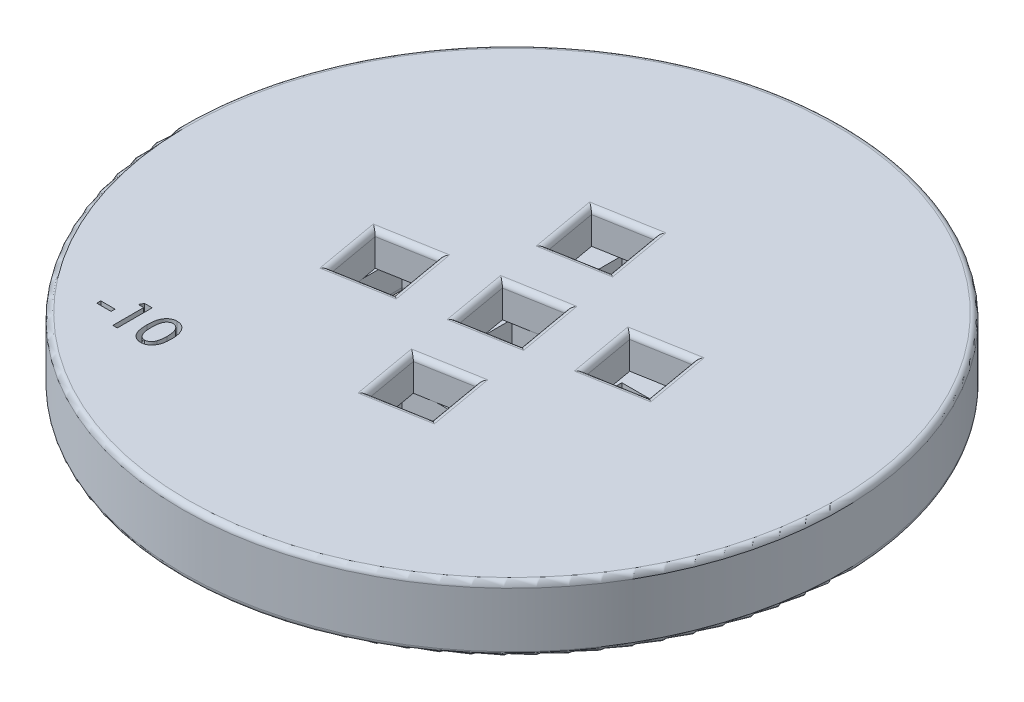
from build123d import *

# Parameters (mm, degrees)
SKETCH1_R           = 30
BOSS_EXTRUDE1_DEPTH = 6
SKETCH4_W           = 5
SKETCH4_H           = 5
CUT_EXTRUDE2_DEPTH  = 3
FILLET2_R           = 0.5
FILLET3_R           = 0.5
SKETCH6_W           = 1.302564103
SKETCH6_H           = 0.366346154
CUT_EXTRUDE3_DEPTH  = 3
FILLET5_R           = 0.5


with BuildPart() as part:
    # Sketch1 → Boss-Extrude1 (new body)
    with BuildSketch(Plane(origin=(0, 0, 0), x_dir=(1, 0, 0), z_dir=(0, 1, 0))):
        with Locations(Location((0, 0, 0), (0, 0, 270))):
            Circle(SKETCH1_R)
    extrude(amount=BOSS_EXTRUDE1_DEPTH)

    # Sketch4 → Cut-Extrude2 (cut)
    with BuildSketch(Plane(origin=(0, 0, 0), x_dir=(-1, 0, 0), z_dir=(0, -1, 0))):
        Rectangle(SKETCH4_W, SKETCH4_H)
        with Locations((0, -10)):
            Rectangle(SKETCH4_W, SKETCH4_H)
        with Locations((10, 0)):
            Rectangle(SKETCH4_W, SKETCH4_H)
        with Locations((-10, 0)):
            Rectangle(SKETCH4_W, SKETCH4_H)
        with Locations((0, 10)):
            Rectangle(SKETCH4_W, SKETCH4_H)
    extrude(amount=-CUT_EXTRUDE2_DEPTH, mode=Mode.SUBTRACT)

    # Fillet2
    fillet2_edges = [part.edges().sort_by_distance(p)[0] for p in [
        (0, 0, -30),
        (-2.5, 0, 10),
        (0, 0, 7.5),
        (2.5, 0, 10),
        (0, 0, 12.5),
        (-12.5, 0, 0),
        (-10, 0, -2.5),
        (-7.5, 0, 0),
        (-10, 0, 2.5),
        (7.5, 0, 0),
        (10, 0, -2.5),
        (12.5, 0, 0),
        (10, 0, 2.5),
        (2.5, 0, -10),
        (0, 0, -7.5),
        (-2.5, 0, -10),
        (0, 0, -12.5),
        (-2.5, 0, 0),
        (0, 0, -2.5),
        (2.5, 0, 0),
        (0, 0, 2.5),
    ]]
    fillet(fillet2_edges, radius=FILLET2_R)

    # Fillet3
    fillet3_edges = [part.edges().sort_by_distance(p)[0] for p in [
        (0, 6, -30),
    ]]
    fillet(fillet3_edges, radius=FILLET3_R)

    # Sketch6 → Cut-Extrude3 (cut)
    # profile 1 of 8: a face of its own
    with BuildSketch(Plane(origin=(0, 6, 0), x_dir=(1, 0, 0), z_dir=(0, 1, 0))):
        Polygon((-2.027898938, -2.896139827), (2.896139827, -2.027898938), (2.027898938, 2.896139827), (-2.896139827, 2.027898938), align=None)
    # profile 2 of 8: a face of its own
    with BuildSketch(Plane(origin=(0, 6, 0), x_dir=(1, 0, 0), z_dir=(0, 1, 0))):
        Polygon((-3.764380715, 6.951937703), (1.15965805, 7.820178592), (0.291417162, 12.744217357), (-4.632621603, 11.875976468), align=None)
    # profile 3 of 8: a face of its own
    with BuildSketch(Plane(origin=(0, 6, 0), x_dir=(1, 0, 0), z_dir=(0, 1, 0))):
        Polygon((4.632621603, -11.875976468), (-0.291417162, -12.744217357), (-1.15965805, -7.820178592), (3.764380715, -6.951937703), align=None)
    # profile 4 of 8: a face of its own
    with BuildSketch(Plane(origin=(0, 6, 0), x_dir=(1, 0, 0), z_dir=(0, 1, 0))):
        Polygon((12.744217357, -0.291417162), (7.820178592, -1.15965805), (6.951937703, 3.764380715), (11.875976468, 4.632621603), align=None)
    # profile 5 of 8: a face of its own
    with BuildSketch(Plane(origin=(0, 6, 0), x_dir=(1, 0, 0), z_dir=(0, 1, 0))):
        Polygon((-11.875976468, -4.632621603), (-6.951937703, -3.764380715), (-7.820178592, 1.15965805), (-12.744217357, 0.291417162), align=None)
    # profile 6 of 8: a face of its own
    with BuildSketch(Plane(origin=(0, 6, 0), x_dir=(1, 0, 0), z_dir=(0, 1, 0))):
        with Locations((-19.019069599, -17.945677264)):
            Rectangle(SKETCH6_W, SKETCH6_H)
    # profile 7 of 8: a face of its own
    with BuildSketch(Plane(origin=(0, 6, 0), x_dir=(1, 0, 0), z_dir=(0, 1, 0))):
        Polygon((-17.471002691, -15.971478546), (-16.780287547, -15.971478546), (-16.780287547, -19.146478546), (-17.187338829, -19.146478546), (-17.187338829, -16.3378247), (-17.675800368, -16.3378247), align=None)
    # profile 8 of 8: a face of its own
    with BuildSketch(Plane(origin=(0, 6, 0), x_dir=(1, 0, 0), z_dir=(0, 1, 0))):
        with BuildLine():
            add(Edge.make_bspline(
                [(-15.681249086, -17.560250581), (-15.680946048, -17.509786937), (-15.680357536, -17.411784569), (-15.674016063, -17.269216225), (-15.663076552, -17.13539443), (-15.649025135, -17.010315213), (-15.629585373, -16.893892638), (-15.607342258, -16.786069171), (-15.579961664, -16.686831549), (-15.547980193, -16.596002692), (-15.512071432, -16.511969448), (-15.472589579, -16.433679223), (-15.429784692, -16.360138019), (-15.383945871, -16.291371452), (-15.332905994, -16.228911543), (-15.279661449, -16.17061922), (-15.222213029, -16.117632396), (-15.161087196, -16.070216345), (-15.09785581, -16.0273477), (-15.031771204, -15.991215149), (-14.964364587, -15.959740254), (-14.894776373, -15.934279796), (-14.823511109, -15.914501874), (-14.75031357, -15.900689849), (-14.675531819, -15.8911783), (-14.624853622, -15.89043957), (-14.5993831, -15.89006829)],
                knots=[0, 0, 0, 0, 1.622528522, 3.151013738, 4.587225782, 5.939257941, 7.196658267, 8.381214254, 9.47772444, 10.503964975, 11.475138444, 12.414102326, 13.321377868, 14.209997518, 15.068075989, 15.912287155, 16.746865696, 17.577313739, 18.397854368, 19.200328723, 19.996378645, 20.787862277, 21.580050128, 22.371504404, 23.181529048, 24, 24, 24, 24], degree=3))
            add(Edge.make_bspline(
                [(-14.5993831, -15.89006829), (-14.571597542, -15.890799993), (-14.516753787, -15.892244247), (-14.435363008, -15.900103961), (-14.356701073, -15.915983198), (-14.279688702, -15.93589638), (-14.205573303, -15.963118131), (-14.132886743, -15.994421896), (-14.063866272, -16.034071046), (-13.996157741, -16.077441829), (-13.932082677, -16.127456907), (-13.87079742, -16.181801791), (-13.814212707, -16.242331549), (-13.76026592, -16.306963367), (-13.711724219, -16.378228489), (-13.66551393, -16.453631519), (-13.624597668, -16.535050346), (-13.585777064, -16.621044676), (-13.552408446, -16.713901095), (-13.522206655, -16.813089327), (-13.497731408, -16.91984514), (-13.477428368, -17.033836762), (-13.461781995, -17.155256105), (-13.450226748, -17.283814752), (-13.444193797, -17.419632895), (-13.443052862, -17.512544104), (-13.442467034, -17.560250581)],
                knots=[0, 0, 0, 0, 0.875057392, 1.727207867, 2.570264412, 3.399251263, 4.229017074, 5.053828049, 5.887584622, 6.731829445, 7.583639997, 8.443960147, 9.308026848, 10.190032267, 11.091770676, 12.020167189, 12.972467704, 13.958579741, 14.989078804, 16.076606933, 17.221320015, 18.435081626, 19.720875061, 21.074561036, 22.497895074, 24, 24, 24, 24], degree=3))
            add(Edge.make_bspline(
                [(-13.442467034, -17.560250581), (-13.443059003, -17.607744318), (-13.444211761, -17.700230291), (-13.45015813, -17.835423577), (-13.462012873, -17.963283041), (-13.476609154, -18.08416755), (-13.49708278, -18.197709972), (-13.522011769, -18.303970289), (-13.549967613, -18.403507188), (-13.58414228, -18.495448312), (-13.62198354, -18.581341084), (-13.663038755, -18.662031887), (-13.70825449, -18.737679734), (-13.758319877, -18.807463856), (-13.810849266, -18.873580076), (-13.868124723, -18.93373049), (-13.929102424, -18.989061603), (-13.993634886, -19.038868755), (-14.060983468, -19.083784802), (-14.131570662, -19.121699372), (-14.203617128, -19.155352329), (-14.278731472, -19.180856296), (-14.355391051, -19.20262184), (-14.434886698, -19.216681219), (-14.516480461, -19.225989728), (-14.571584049, -19.227252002), (-14.5993831, -19.227888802)],
                knots=[0, 0, 0, 0, 1.496607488, 2.914388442, 4.262485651, 5.541812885, 6.749953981, 7.895567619, 8.980172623, 10.005210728, 10.983286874, 11.936336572, 12.856292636, 13.757107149, 14.640766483, 15.514956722, 16.370989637, 17.232841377, 18.081413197, 18.918442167, 19.755471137, 20.583656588, 21.41504191, 22.264086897, 23.124254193, 24, 24, 24, 24], degree=3))
            add(Edge.make_bspline(
                [(-14.5993831, -19.227888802), (-14.625057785, -19.227452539), (-14.675908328, -19.22658849), (-14.750997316, -19.218114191), (-14.824144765, -19.204049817), (-14.895135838, -19.184337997), (-14.964469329, -19.15931156), (-15.031844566, -19.12899553), (-15.096818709, -19.092286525), (-15.160011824, -19.05104087), (-15.220506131, -19.004126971), (-15.276852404, -18.951102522), (-15.330405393, -18.893234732), (-15.380104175, -18.82989957), (-15.427047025, -18.761505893), (-15.469365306, -18.687409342), (-15.508819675, -18.608401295), (-15.54539883, -18.523873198), (-15.578426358, -18.432356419), (-15.604768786, -18.332060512), (-15.62960944, -18.224079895), (-15.647838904, -18.107322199), (-15.66365532, -17.982668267), (-15.672831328, -17.849308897), (-15.680672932, -17.707686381), (-15.681053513, -17.610296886), (-15.681249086, -17.560250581)],
                knots=[0, 0, 0, 0, 0.82614074, 1.636230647, 2.42850654, 3.22151677, 4.005075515, 4.799112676, 5.596456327, 6.404618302, 7.226350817, 8.05679228, 8.892237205, 9.761873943, 10.645770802, 11.559890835, 12.505927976, 13.487073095, 14.523090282, 15.633895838, 16.822583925, 18.088023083, 19.435493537, 20.865857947, 22.389433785, 24, 24, 24, 24], degree=3))
        make_face()
        with BuildLine():
            add(Edge.make_bspline(
                [(-15.274197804, -17.558978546), (-15.274034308, -17.601596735), (-15.273717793, -17.684102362), (-15.269018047, -17.803491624), (-15.262326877, -17.914661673), (-15.252317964, -18.017582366), (-15.238971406, -18.112406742), (-15.223174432, -18.199003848), (-15.20516351, -18.27753959), (-15.183205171, -18.348143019), (-15.158891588, -18.41247375), (-15.131858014, -18.47169828), (-15.103788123, -18.527158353), (-15.072168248, -18.577754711), (-15.038682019, -18.624178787), (-15.00272477, -18.66625387), (-14.965580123, -18.70490223), (-14.912592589, -18.747817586), (-14.844699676, -18.792685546), (-14.760418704, -18.831592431), (-14.675502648, -18.857274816), (-14.61821307, -18.860129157), (-14.589842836, -18.861542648)],
                knots=[0, 0, 0, 0, 1.564601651, 3.028951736, 4.386019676, 5.653114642, 6.824348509, 7.900668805, 8.88431448, 9.780488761, 10.613163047, 11.407444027, 12.169849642, 12.89344098, 13.595615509, 14.26934431, 14.924332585, 15.560171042, 16.769153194, 17.901006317, 18.960562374, 20, 20, 20, 20], degree=3))
            add(Edge.make_bspline(
                [(-14.589842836, -18.861542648), (-14.557693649, -18.859860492), (-14.493595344, -18.856506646), (-14.399193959, -18.832086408), (-14.308678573, -18.79110048), (-14.236958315, -18.744795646), (-14.182770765, -18.699758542), (-14.143637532, -18.661418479), (-14.107567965, -18.618614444), (-14.073517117, -18.571998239), (-14.042728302, -18.520807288), (-14.013040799, -18.466203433), (-13.987192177, -18.406876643), (-13.972253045, -18.365535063), (-13.964637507, -18.344460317)],
                knots=[0, 0, 0, 0, 1.331887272, 2.655486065, 4.012646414, 5.436183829, 6.178803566, 6.930724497, 7.703763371, 8.496530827, 9.320959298, 10.178042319, 11.071218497, 12, 12, 12, 12], degree=3))
            add(Edge.make_bspline(
                [(-13.964637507, -18.344460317), (-13.95546254, -18.316771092), (-13.936758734, -18.260324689), (-13.913325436, -18.172441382), (-13.89392555, -18.080225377), (-13.877221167, -17.984167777), (-13.864537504, -17.883784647), (-13.855770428, -17.779172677), (-13.850741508, -17.670331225), (-13.849930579, -17.596508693), (-13.849518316, -17.558978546)],
                knots=[0, 0, 0, 0, 0.877617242, 1.789083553, 2.735016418, 3.71249782, 4.722174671, 5.778575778, 6.870664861, 8, 8, 8, 8], degree=3))
            add(Edge.make_bspline(
                [(-13.849518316, -17.558978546), (-13.849616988, -17.521444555), (-13.849809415, -17.44824699), (-13.855528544, -17.34117686), (-13.862445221, -17.239260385), (-13.874377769, -17.142832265), (-13.88773216, -17.051411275), (-13.906049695, -16.96564376), (-13.925696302, -16.884673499), (-13.950240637, -16.80950055), (-13.977074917, -16.739366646), (-14.005377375, -16.674038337), (-14.035979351, -16.613463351), (-14.069695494, -16.558401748), (-14.105281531, -16.507945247), (-14.142870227, -16.462397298), (-14.183021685, -16.422014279), (-14.23915479, -16.376481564), (-14.311517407, -16.329091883), (-14.402000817, -16.286562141), (-14.495433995, -16.261489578), (-14.558537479, -16.258097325), (-14.589842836, -16.256414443)],
                knots=[0, 0, 0, 0, 1.353201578, 2.638969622, 3.865559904, 5.035676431, 6.141732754, 7.195734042, 8.19695873, 9.144657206, 10.044788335, 10.904062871, 11.710933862, 12.489720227, 13.229995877, 13.935715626, 14.616825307, 15.279494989, 16.538995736, 17.725922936, 18.871840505, 20, 20, 20, 20], degree=3))
            add(Edge.make_bspline(
                [(-14.589842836, -16.256414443), (-14.618204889, -16.257855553), (-14.675682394, -16.260776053), (-14.760727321, -16.286101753), (-14.844704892, -16.325317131), (-14.912142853, -16.370216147), (-14.964692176, -16.41308599), (-15.00234393, -16.450855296), (-15.037129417, -16.493168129), (-15.070698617, -16.539218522), (-15.101351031, -16.590147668), (-15.131122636, -16.645026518), (-15.157353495, -16.704761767), (-15.182022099, -16.769141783), (-15.203749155, -16.839874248), (-15.222538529, -16.918290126), (-15.239329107, -17.004791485), (-15.25143002, -17.09980723), (-15.26160246, -17.20288428), (-15.269215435, -17.31422856), (-15.273660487, -17.433857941), (-15.274014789, -17.51636145), (-15.274197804, -17.558978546)],
                knots=[0, 0, 0, 0, 1.039778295, 2.107176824, 3.232337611, 4.43520669, 5.071253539, 5.720927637, 6.389866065, 7.081397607, 7.811854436, 8.571243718, 9.372887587, 10.205834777, 11.102302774, 12.088086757, 13.166194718, 14.33675119, 15.604261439, 16.970055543, 18.43488556, 20, 20, 20, 20], degree=3))
        make_face(mode=Mode.SUBTRACT)
    extrude(amount=-CUT_EXTRUDE3_DEPTH, mode=Mode.SUBTRACT)

    # Fillet5
    fillet5_edges = [part.edges().sort_by_distance(p)[0] for p in [
        (-2.462019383, 6, 0.434120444),
        (0.434120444, 6, 2.462019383),
        (2.462019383, 6, -0.434120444),
        (-0.434120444, 6, -2.462019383),
        (-4.198501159, 6, -9.413957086),
        (-1.302361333, 6, -7.386058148),
        (0.725537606, 6, -10.282197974),
        (-2.170602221, 6, -12.310096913),
        (4.198501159, 6, 9.413957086),
        (1.302361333, 6, 7.386058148),
        (-0.725537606, 6, 10.282197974),
        (2.170602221, 6, 12.310096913),
        (12.310096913, 6, -2.170602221),
        (9.413957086, 6, -4.198501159),
        (7.386058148, 6, -1.302361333),
        (10.282197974, 6, 0.725537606),
        (-12.310096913, 6, 2.170602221),
        (-9.413957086, 6, 4.198501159),
        (-7.386058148, 6, 1.302361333),
        (-10.282197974, 6, -0.725537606),
    ]]
    fillet(fillet5_edges, radius=FILLET5_R)


solid = part.part
